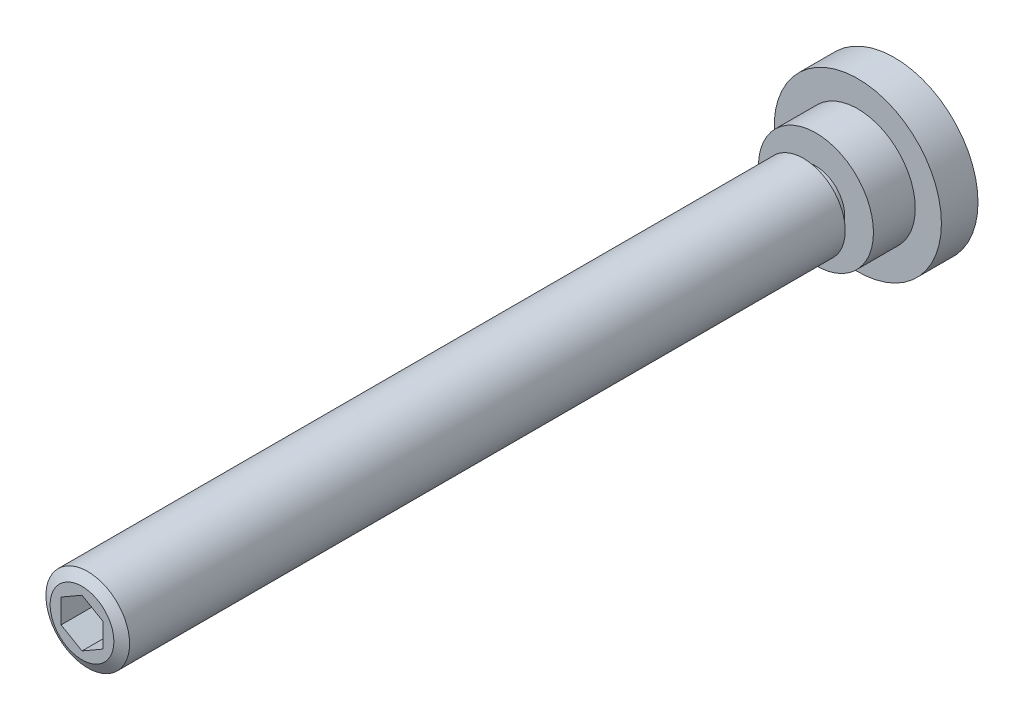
ISO-10303-21;
HEADER;
FILE_DESCRIPTION(('STEP AP214'),'2;1');
FILE_NAME('part.step','',(''),(''),'','','');
FILE_SCHEMA(('AUTOMOTIVE_DESIGN { 1 0 10303 214 1 1 1 1 }'));
ENDSEC;
DATA;
#1=APPLICATION_CONTEXT('core data for automotive mechanical design processes');
#2=APPLICATION_PROTOCOL_DEFINITION('international standard','automotive_design',2000,#1);
#3=PRODUCT_CONTEXT('',#1,'mechanical');
#4=PRODUCT('Part','Part','',(#3));
#5=PRODUCT_RELATED_PRODUCT_CATEGORY('part','',(#4));
#6=PRODUCT_DEFINITION_FORMATION('','',#4);
#7=PRODUCT_DEFINITION_CONTEXT('part definition',#1,'design');
#8=PRODUCT_DEFINITION('design','',#6,#7);
#9=PRODUCT_DEFINITION_SHAPE('','',#8);
#10=(LENGTH_UNIT() NAMED_UNIT(*) SI_UNIT(.MILLI.,.METRE.));
#11=(NAMED_UNIT(*) PLANE_ANGLE_UNIT() SI_UNIT($,.RADIAN.));
#12=(NAMED_UNIT(*) SI_UNIT($,.STERADIAN.) SOLID_ANGLE_UNIT());
#13=UNCERTAINTY_MEASURE_WITH_UNIT(LENGTH_MEASURE(1.E-05),#10,'distance_accuracy_value','');
#14=(GEOMETRIC_REPRESENTATION_CONTEXT(3) GLOBAL_UNCERTAINTY_ASSIGNED_CONTEXT((#13)) GLOBAL_UNIT_ASSIGNED_CONTEXT((#10,
#11,#12)) REPRESENTATION_CONTEXT('',''));
#15=CARTESIAN_POINT('',(0.,0.,0.));
#16=DIRECTION('',(0.,0.,1.));
#17=DIRECTION('',(1.,0.,0.));
#18=AXIS2_PLACEMENT_3D('',#15,#16,#17);
#19=CARTESIAN_POINT('',(-8.,0.,15.));
#20=DIRECTION('',(0.,0.,1.));
#21=DIRECTION('',(1.,0.,0.));
#22=AXIS2_PLACEMENT_3D('',#19,#20,#21);
#23=PLANE('',#22);
#24=CARTESIAN_POINT('',(0.,0.,15.));
#25=DIRECTION('',(0.,0.,1.));
#26=DIRECTION('',(1.,0.,0.));
#27=AXIS2_PLACEMENT_3D('',#24,#25,#26);
#28=CIRCLE('',#27,11.);
#29=CARTESIAN_POINT('',(11.,0.,15.));
#30=VERTEX_POINT('',#29);
#31=EDGE_CURVE('E131',#30,#30,#28,.T.);
#32=ORIENTED_EDGE('',*,*,#31,.T.);
#33=EDGE_LOOP('',(#32));
#34=FACE_BOUND('',#33,.T.);
#35=CARTESIAN_POINT('',(0.,0.,15.));
#36=DIRECTION('',(0.,0.,-1.));
#37=DIRECTION('',(-1.,0.,0.));
#38=AXIS2_PLACEMENT_3D('',#35,#36,#37);
#39=CIRCLE('',#38,5.5);
#40=CARTESIAN_POINT('',(-5.5,0.,15.));
#41=VERTEX_POINT('',#40);
#42=EDGE_CURVE('E314',#41,#41,#39,.T.);
#43=ORIENTED_EDGE('',*,*,#42,.T.);
#44=EDGE_LOOP('',(#43));
#45=FACE_BOUND('',#44,.T.);
#46=ADVANCED_FACE('F14',(#34,#45),#23,.T.);
#47=CARTESIAN_POINT('',(0.,0.,30.));
#48=DIRECTION('',(0.,0.,1.));
#49=DIRECTION('',(1.,0.,0.));
#50=AXIS2_PLACEMENT_3D('',#47,#48,#49);
#51=CYLINDRICAL_SURFACE('',#50,11.);
#52=CARTESIAN_POINT('',(0.,0.,7.));
#53=DIRECTION('',(0.,0.,1.));
#54=DIRECTION('',(1.,0.,0.));
#55=AXIS2_PLACEMENT_3D('',#52,#53,#54);
#56=CIRCLE('',#55,11.);
#57=CARTESIAN_POINT('',(11.,0.,7.));
#58=VERTEX_POINT('',#57);
#59=EDGE_CURVE('E128',#58,#58,#56,.T.);
#60=ORIENTED_EDGE('',*,*,#59,.T.);
#61=EDGE_LOOP('',(#60));
#62=FACE_BOUND('',#61,.T.);
#63=ORIENTED_EDGE('',*,*,#31,.F.);
#64=EDGE_LOOP('',(#63));
#65=FACE_BOUND('',#64,.T.);
#66=ADVANCED_FACE('F149',(#62,#65),#51,.T.);
#67=CARTESIAN_POINT('',(-11.,0.,7.));
#68=DIRECTION('',(0.,0.,1.));
#69=DIRECTION('',(1.,0.,0.));
#70=AXIS2_PLACEMENT_3D('',#67,#68,#69);
#71=PLANE('',#70);
#72=CARTESIAN_POINT('',(0.,0.,7.));
#73=DIRECTION('',(0.,0.,1.));
#74=DIRECTION('',(1.,0.,0.));
#75=AXIS2_PLACEMENT_3D('',#72,#73,#74);
#76=CIRCLE('',#75,16.);
#77=CARTESIAN_POINT('',(16.,0.,7.));
#78=VERTEX_POINT('',#77);
#79=EDGE_CURVE('E125',#78,#78,#76,.T.);
#80=ORIENTED_EDGE('',*,*,#79,.T.);
#81=EDGE_LOOP('',(#80));
#82=FACE_BOUND('',#81,.T.);
#83=ORIENTED_EDGE('',*,*,#59,.F.);
#84=EDGE_LOOP('',(#83));
#85=FACE_BOUND('',#84,.T.);
#86=ADVANCED_FACE('F156',(#82,#85),#71,.T.);
#87=CARTESIAN_POINT('',(0.,0.,30.));
#88=DIRECTION('',(0.,0.,1.));
#89=DIRECTION('',(1.,0.,0.));
#90=AXIS2_PLACEMENT_3D('',#87,#88,#89);
#91=CYLINDRICAL_SURFACE('',#90,16.);
#92=CARTESIAN_POINT('',(0.,0.,0.));
#93=DIRECTION('',(0.,0.,1.));
#94=DIRECTION('',(1.,0.,0.));
#95=AXIS2_PLACEMENT_3D('',#92,#93,#94);
#96=CIRCLE('',#95,16.);
#97=CARTESIAN_POINT('',(16.,0.,0.));
#98=VERTEX_POINT('',#97);
#99=EDGE_CURVE('E116',#98,#98,#96,.T.);
#100=ORIENTED_EDGE('',*,*,#99,.T.);
#101=EDGE_LOOP('',(#100));
#102=FACE_BOUND('',#101,.T.);
#103=ORIENTED_EDGE('',*,*,#79,.F.);
#104=EDGE_LOOP('',(#103));
#105=FACE_BOUND('',#104,.T.);
#106=ADVANCED_FACE('F182',(#102,#105),#91,.T.);
#107=CARTESIAN_POINT('',(-16.,0.,0.));
#108=DIRECTION('',(0.,0.,-1.));
#109=DIRECTION('',(-1.,0.,0.));
#110=AXIS2_PLACEMENT_3D('',#107,#108,#109);
#111=PLANE('',#110);
#112=ORIENTED_EDGE('',*,*,#99,.F.);
#113=EDGE_LOOP('',(#112));
#114=FACE_BOUND('',#113,.T.);
#115=ADVANCED_FACE('F178',(#114),#111,.T.);
#116=CARTESIAN_POINT('',(0.,0.,0.));
#117=DIRECTION('',(0.,0.,-1.));
#118=DIRECTION('',(-1.,0.,0.));
#119=AXIS2_PLACEMENT_3D('',#116,#117,#118);
#120=CYLINDRICAL_SURFACE('',#119,5.5);
#121=ORIENTED_EDGE('',*,*,#42,.F.);
#122=EDGE_LOOP('',(#121));
#123=FACE_BOUND('',#122,.T.);
#124=CARTESIAN_POINT('',(0.,0.,15.9566243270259));
#125=DIRECTION('',(0.,0.,-1.));
#126=DIRECTION('',(-1.,0.,0.));
#127=AXIS2_PLACEMENT_3D('',#124,#125,#126);
#128=CIRCLE('',#127,5.5);
#129=CARTESIAN_POINT('',(-5.5,0.,15.9566243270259));
#130=VERTEX_POINT('',#129);
#131=EDGE_CURVE('E316',#130,#130,#128,.T.);
#132=ORIENTED_EDGE('',*,*,#131,.T.);
#133=EDGE_LOOP('',(#132));
#134=FACE_BOUND('',#133,.T.);
#135=ADVANCED_FACE('F181',(#123,#134),#120,.T.);
#136=CARTESIAN_POINT('',(0.,0.,17.4));
#137=DIRECTION('',(0.,0.,1.));
#138=DIRECTION('',(1.,0.,0.));
#139=AXIS2_PLACEMENT_3D('',#136,#137,#138);
#140=CONICAL_SURFACE('',#139,8.,1.04719755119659);
#141=ORIENTED_EDGE('',*,*,#131,.F.);
#142=EDGE_LOOP('',(#141));
#143=FACE_BOUND('',#142,.T.);
#144=CARTESIAN_POINT('',(0.,0.,17.4));
#145=DIRECTION('',(0.,0.,-1.));
#146=DIRECTION('',(-1.,0.,0.));
#147=AXIS2_PLACEMENT_3D('',#144,#145,#146);
#148=CIRCLE('',#147,8.);
#149=CARTESIAN_POINT('',(-8.,0.,17.4));
#150=VERTEX_POINT('',#149);
#151=EDGE_CURVE('E321',#150,#150,#148,.T.);
#152=ORIENTED_EDGE('',*,*,#151,.T.);
#153=EDGE_LOOP('',(#152));
#154=FACE_BOUND('',#153,.T.);
#155=ADVANCED_FACE('F220',(#143,#154),#140,.T.);
#156=CARTESIAN_POINT('',(4.,2.30940107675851,149.4));
#157=DIRECTION('',(0.,0.,-1.));
#158=DIRECTION('',(-1.,0.,0.));
#159=AXIS2_PLACEMENT_3D('',#156,#157,#158);
#160=PLANE('',#159);
#161=DIRECTION('',(-0.866025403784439,0.5,0.));
#162=VECTOR('',#161,1.);
#163=CARTESIAN_POINT('',(4.,2.30940107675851,149.4));
#164=LINE('',#163,#162);
#165=CARTESIAN_POINT('',(4.,2.30940107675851,149.4));
#166=VERTEX_POINT('',#165);
#167=CARTESIAN_POINT('',(0.,4.618802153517,149.4));
#168=VERTEX_POINT('',#167);
#169=EDGE_CURVE('E100',#166,#168,#164,.T.);
#170=ORIENTED_EDGE('',*,*,#169,.T.);
#171=DIRECTION('',(-0.866025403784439,-0.5,0.));
#172=VECTOR('',#171,1.);
#173=CARTESIAN_POINT('',(0.,4.618802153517,149.4));
#174=LINE('',#173,#172);
#175=CARTESIAN_POINT('',(-4.,2.3094010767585,149.4));
#176=VERTEX_POINT('',#175);
#177=EDGE_CURVE('E103',#168,#176,#174,.T.);
#178=ORIENTED_EDGE('',*,*,#177,.T.);
#179=DIRECTION('',(0.,-1.,0.));
#180=VECTOR('',#179,1.);
#181=CARTESIAN_POINT('',(-4.,2.3094010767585,149.4));
#182=LINE('',#181,#180);
#183=CARTESIAN_POINT('',(-4.,-2.3094010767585,149.4));
#184=VERTEX_POINT('',#183);
#185=EDGE_CURVE('E75',#176,#184,#182,.T.);
#186=ORIENTED_EDGE('',*,*,#185,.T.);
#187=DIRECTION('',(0.866025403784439,-0.5,0.));
#188=VECTOR('',#187,1.);
#189=CARTESIAN_POINT('',(-4.,-2.3094010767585,149.4));
#190=LINE('',#189,#188);
#191=CARTESIAN_POINT('',(0.,-4.618802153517,149.4));
#192=VERTEX_POINT('',#191);
#193=EDGE_CURVE('E106',#184,#192,#190,.T.);
#194=ORIENTED_EDGE('',*,*,#193,.T.);
#195=DIRECTION('',(0.866025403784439,0.5,0.));
#196=VECTOR('',#195,1.);
#197=CARTESIAN_POINT('',(0.,-4.618802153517,149.4));
#198=LINE('',#197,#196);
#199=CARTESIAN_POINT('',(4.,-2.3094010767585,149.4));
#200=VERTEX_POINT('',#199);
#201=EDGE_CURVE('E109',#192,#200,#198,.T.);
#202=ORIENTED_EDGE('',*,*,#201,.T.);
#203=DIRECTION('',(0.,1.,0.));
#204=VECTOR('',#203,1.);
#205=CARTESIAN_POINT('',(4.,-2.3094010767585,149.4));
#206=LINE('',#205,#204);
#207=EDGE_CURVE('E112',#200,#166,#206,.T.);
#208=ORIENTED_EDGE('',*,*,#207,.T.);
#209=EDGE_LOOP('',(#170,#178,#186,#194,#202,#208));
#210=FACE_BOUND('',#209,.T.);
#211=ADVANCED_FACE('F229',(#210),#160,.F.);
#212=CARTESIAN_POINT('',(0.,4.618802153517,149.4));
#213=DIRECTION('',(-0.5,0.866025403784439,0.));
#214=DIRECTION('',(-0.866025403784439,-0.5,0.));
#215=AXIS2_PLACEMENT_3D('',#212,#213,#214);
#216=PLANE('',#215);
#217=DIRECTION('',(-0.866025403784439,-0.5,0.));
#218=VECTOR('',#217,1.);
#219=CARTESIAN_POINT('',(0.,4.618802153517,155.4));
#220=LINE('',#219,#218);
#221=CARTESIAN_POINT('',(0.,4.618802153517,155.4));
#222=VERTEX_POINT('',#221);
#223=CARTESIAN_POINT('',(-4.,2.3094010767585,155.4));
#224=VERTEX_POINT('',#223);
#225=EDGE_CURVE('E83',#222,#224,#220,.T.);
#226=ORIENTED_EDGE('',*,*,#225,.T.);
#227=DIRECTION('',(0.,0.,1.));
#228=VECTOR('',#227,1.);
#229=CARTESIAN_POINT('',(-4.,2.3094010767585,149.4));
#230=LINE('',#229,#228);
#231=EDGE_CURVE('E68',#176,#224,#230,.T.);
#232=ORIENTED_EDGE('',*,*,#231,.F.);
#233=ORIENTED_EDGE('',*,*,#177,.F.);
#234=DIRECTION('',(0.,0.,1.));
#235=VECTOR('',#234,1.);
#236=CARTESIAN_POINT('',(0.,4.618802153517,149.4));
#237=LINE('',#236,#235);
#238=EDGE_CURVE('E80',#168,#222,#237,.T.);
#239=ORIENTED_EDGE('',*,*,#238,.T.);
#240=EDGE_LOOP('',(#226,#232,#233,#239));
#241=FACE_BOUND('',#240,.T.);
#242=ADVANCED_FACE('F84',(#241),#216,.F.);
#243=CARTESIAN_POINT('',(-4.,2.3094010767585,149.4));
#244=DIRECTION('',(-1.,0.,0.));
#245=DIRECTION('',(0.,-1.,0.));
#246=AXIS2_PLACEMENT_3D('',#243,#244,#245);
#247=PLANE('',#246);
#248=DIRECTION('',(0.,-1.,0.));
#249=VECTOR('',#248,1.);
#250=CARTESIAN_POINT('',(-4.,2.3094010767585,155.4));
#251=LINE('',#250,#249);
#252=CARTESIAN_POINT('',(-4.,-2.3094010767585,155.4));
#253=VERTEX_POINT('',#252);
#254=EDGE_CURVE('E72',#224,#253,#251,.T.);
#255=ORIENTED_EDGE('',*,*,#254,.T.);
#256=DIRECTION('',(0.,0.,1.));
#257=VECTOR('',#256,1.);
#258=CARTESIAN_POINT('',(-4.,-2.3094010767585,149.4));
#259=LINE('',#258,#257);
#260=EDGE_CURVE('E79',#184,#253,#259,.T.);
#261=ORIENTED_EDGE('',*,*,#260,.F.);
#262=ORIENTED_EDGE('',*,*,#185,.F.);
#263=ORIENTED_EDGE('',*,*,#231,.T.);
#264=EDGE_LOOP('',(#255,#261,#262,#263));
#265=FACE_BOUND('',#264,.T.);
#266=ADVANCED_FACE('F70',(#265),#247,.F.);
#267=CARTESIAN_POINT('',(-4.,-2.3094010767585,149.4));
#268=DIRECTION('',(-0.5,-0.866025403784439,0.));
#269=DIRECTION('',(0.866025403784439,-0.5,0.));
#270=AXIS2_PLACEMENT_3D('',#267,#268,#269);
#271=PLANE('',#270);
#272=DIRECTION('',(0.866025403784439,-0.5,0.));
#273=VECTOR('',#272,1.);
#274=CARTESIAN_POINT('',(-4.,-2.3094010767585,155.4));
#275=LINE('',#274,#273);
#276=CARTESIAN_POINT('',(0.,-4.618802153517,155.4));
#277=VERTEX_POINT('',#276);
#278=EDGE_CURVE('E90',#253,#277,#275,.T.);
#279=ORIENTED_EDGE('',*,*,#278,.T.);
#280=DIRECTION('',(0.,0.,1.));
#281=VECTOR('',#280,1.);
#282=CARTESIAN_POINT('',(0.,-4.618802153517,149.4));
#283=LINE('',#282,#281);
#284=EDGE_CURVE('E119',#192,#277,#283,.T.);
#285=ORIENTED_EDGE('',*,*,#284,.F.);
#286=ORIENTED_EDGE('',*,*,#193,.F.);
#287=ORIENTED_EDGE('',*,*,#260,.T.);
#288=EDGE_LOOP('',(#279,#285,#286,#287));
#289=FACE_BOUND('',#288,.T.);
#290=ADVANCED_FACE('F252',(#289),#271,.F.);
#291=CARTESIAN_POINT('',(0.,-4.618802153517,149.4));
#292=DIRECTION('',(0.5,-0.866025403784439,0.));
#293=DIRECTION('',(0.866025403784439,0.5,0.));
#294=AXIS2_PLACEMENT_3D('',#291,#292,#293);
#295=PLANE('',#294);
#296=DIRECTION('',(0.866025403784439,0.5,0.));
#297=VECTOR('',#296,1.);
#298=CARTESIAN_POINT('',(0.,-4.618802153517,155.4));
#299=LINE('',#298,#297);
#300=CARTESIAN_POINT('',(4.,-2.3094010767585,155.4));
#301=VERTEX_POINT('',#300);
#302=EDGE_CURVE('E92',#277,#301,#299,.T.);
#303=ORIENTED_EDGE('',*,*,#302,.T.);
#304=DIRECTION('',(0.,0.,1.));
#305=VECTOR('',#304,1.);
#306=CARTESIAN_POINT('',(4.,-2.3094010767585,149.4));
#307=LINE('',#306,#305);
#308=EDGE_CURVE('E117',#200,#301,#307,.T.);
#309=ORIENTED_EDGE('',*,*,#308,.F.);
#310=ORIENTED_EDGE('',*,*,#201,.F.);
#311=ORIENTED_EDGE('',*,*,#284,.T.);
#312=EDGE_LOOP('',(#303,#309,#310,#311));
#313=FACE_BOUND('',#312,.T.);
#314=ADVANCED_FACE('F173',(#313),#295,.F.);
#315=CARTESIAN_POINT('',(4.,-2.3094010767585,149.4));
#316=DIRECTION('',(1.,0.,0.));
#317=DIRECTION('',(0.,0.,-1.));
#318=AXIS2_PLACEMENT_3D('',#315,#316,#317);
#319=PLANE('',#318);
#320=DIRECTION('',(0.,1.,0.));
#321=VECTOR('',#320,1.);
#322=CARTESIAN_POINT('',(4.,-2.3094010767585,155.4));
#323=LINE('',#322,#321);
#324=CARTESIAN_POINT('',(4.,2.30940107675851,155.4));
#325=VERTEX_POINT('',#324);
#326=EDGE_CURVE('E98',#301,#325,#323,.T.);
#327=ORIENTED_EDGE('',*,*,#326,.T.);
#328=DIRECTION('',(0.,0.,1.));
#329=VECTOR('',#328,1.);
#330=CARTESIAN_POINT('',(4.,2.30940107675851,149.4));
#331=LINE('',#330,#329);
#332=EDGE_CURVE('E36',#166,#325,#331,.T.);
#333=ORIENTED_EDGE('',*,*,#332,.F.);
#334=ORIENTED_EDGE('',*,*,#207,.F.);
#335=ORIENTED_EDGE('',*,*,#308,.T.);
#336=EDGE_LOOP('',(#327,#333,#334,#335));
#337=FACE_BOUND('',#336,.T.);
#338=ADVANCED_FACE('F167',(#337),#319,.F.);
#339=CARTESIAN_POINT('',(4.,2.30940107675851,149.4));
#340=DIRECTION('',(0.5,0.866025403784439,0.));
#341=DIRECTION('',(-0.866025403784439,0.5,0.));
#342=AXIS2_PLACEMENT_3D('',#339,#340,#341);
#343=PLANE('',#342);
#344=DIRECTION('',(-0.866025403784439,0.5,0.));
#345=VECTOR('',#344,1.);
#346=CARTESIAN_POINT('',(4.,2.30940107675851,155.4));
#347=LINE('',#346,#345);
#348=EDGE_CURVE('E29',#325,#222,#347,.T.);
#349=ORIENTED_EDGE('',*,*,#348,.T.);
#350=ORIENTED_EDGE('',*,*,#238,.F.);
#351=ORIENTED_EDGE('',*,*,#169,.F.);
#352=ORIENTED_EDGE('',*,*,#332,.T.);
#353=EDGE_LOOP('',(#349,#350,#351,#352));
#354=FACE_BOUND('',#353,.T.);
#355=ADVANCED_FACE('F162',(#354),#343,.F.);
#356=CARTESIAN_POINT('',(0.,0.,155.4));
#357=DIRECTION('',(0.,0.,1.));
#358=DIRECTION('',(1.,0.,0.));
#359=AXIS2_PLACEMENT_3D('',#356,#357,#358);
#360=PLANE('',#359);
#361=CARTESIAN_POINT('',(0.,0.,155.4));
#362=DIRECTION('',(0.,0.,1.));
#363=DIRECTION('',(1.,0.,0.));
#364=AXIS2_PLACEMENT_3D('',#361,#362,#363);
#365=CIRCLE('',#364,6.09474411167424);
#366=CARTESIAN_POINT('',(6.09474411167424,0.,155.4));
#367=VERTEX_POINT('',#366);
#368=EDGE_CURVE('E22',#367,#367,#365,.T.);
#369=ORIENTED_EDGE('',*,*,#368,.T.);
#370=EDGE_LOOP('',(#369));
#371=FACE_BOUND('',#370,.T.);
#372=ORIENTED_EDGE('',*,*,#348,.F.);
#373=ORIENTED_EDGE('',*,*,#326,.F.);
#374=ORIENTED_EDGE('',*,*,#302,.F.);
#375=ORIENTED_EDGE('',*,*,#278,.F.);
#376=ORIENTED_EDGE('',*,*,#254,.F.);
#377=ORIENTED_EDGE('',*,*,#225,.F.);
#378=EDGE_LOOP('',(#372,#373,#374,#375,#376,#377));
#379=FACE_BOUND('',#378,.T.);
#380=ADVANCED_FACE('F87',(#371,#379),#360,.T.);
#381=CARTESIAN_POINT('',(0.,0.,30.));
#382=DIRECTION('',(0.,0.,1.));
#383=DIRECTION('',(1.,0.,0.));
#384=AXIS2_PLACEMENT_3D('',#381,#382,#383);
#385=CYLINDRICAL_SURFACE('',#384,8.);
#386=CARTESIAN_POINT('',(0.,0.,154.3));
#387=DIRECTION('',(0.,0.,1.));
#388=DIRECTION('',(1.,0.,0.));
#389=AXIS2_PLACEMENT_3D('',#386,#387,#388);
#390=CIRCLE('',#389,8.);
#391=CARTESIAN_POINT('',(8.,0.,154.3));
#392=VERTEX_POINT('',#391);
#393=EDGE_CURVE('E9',#392,#392,#390,.F.);
#394=ORIENTED_EDGE('',*,*,#393,.T.);
#395=EDGE_LOOP('',(#394));
#396=FACE_BOUND('',#395,.T.);
#397=ORIENTED_EDGE('',*,*,#151,.F.);
#398=EDGE_LOOP('',(#397));
#399=FACE_BOUND('',#398,.T.);
#400=ADVANCED_FACE('F138',(#396,#399),#385,.T.);
#401=CARTESIAN_POINT('',(0.,0.,155.4));
#402=DIRECTION('',(0.,0.,-1.));
#403=DIRECTION('',(-1.,0.,0.));
#404=AXIS2_PLACEMENT_3D('',#401,#402,#403);
#405=CONICAL_SURFACE('',#404,6.09474411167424,1.04719755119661);
#406=ORIENTED_EDGE('',*,*,#393,.F.);
#407=EDGE_LOOP('',(#406));
#408=FACE_BOUND('',#407,.T.);
#409=ORIENTED_EDGE('',*,*,#368,.F.);
#410=EDGE_LOOP('',(#409));
#411=FACE_BOUND('',#410,.T.);
#412=ADVANCED_FACE('F16',(#408,#411),#405,.T.);
#413=CLOSED_SHELL('',(#46,#66,#86,#106,#115,#135,#155,#211,#242,#266,#290,#314,#338,#355,#380,
#400,#412));
#414=MANIFOLD_SOLID_BREP('B1',#413);
#415=ADVANCED_BREP_SHAPE_REPRESENTATION('',(#18,#414),#14);
#416=SHAPE_DEFINITION_REPRESENTATION(#9,#415);
ENDSEC;
END-ISO-10303-21;
